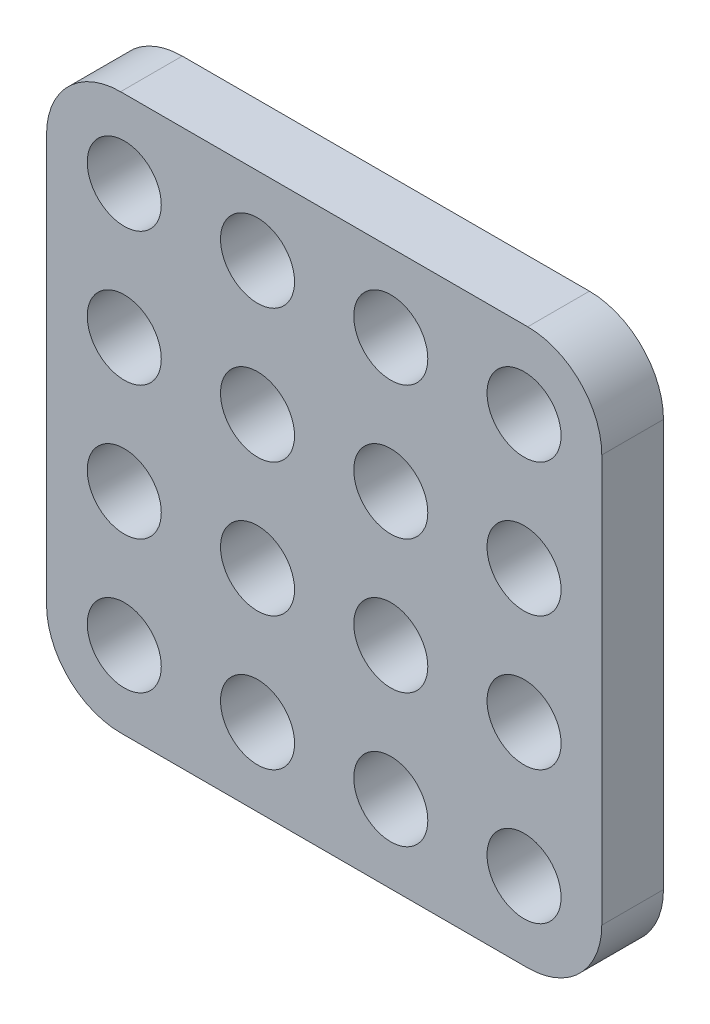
from build123d import *

# Parameters (mm, degrees)
MODEL_R            = 6
BOSS_EXTRU_1_DEPTH = 10


with BuildPart() as part:
    # Model → Boss.-Extru.1 (new body)
    with BuildSketch(Plane.XY):
        with BuildLine():
            Line((105.205005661, 230.510748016), (105.205005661, 164.510748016))
            ThreePointArc((105.205005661, 164.510748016), (101.690287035, 156.025466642), (93.205005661, 152.510748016))
            Line((93.205005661, 152.510748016), (27.205005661, 152.510748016))
            ThreePointArc((27.205005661, 152.510748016), (18.719724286, 156.025466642), (15.205005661, 164.510748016))
            Line((15.205005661, 164.510748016), (15.205005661, 230.510748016))
            ThreePointArc((15.205005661, 230.510748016), (18.719724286, 238.99602939), (27.205005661, 242.510748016))
            Line((27.205005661, 242.510748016), (93.205005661, 242.510748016))
            ThreePointArc((93.205005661, 242.510748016), (101.690287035, 238.99602939), (105.205005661, 230.510748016))
        make_face()
        with Locations((71.005005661, 208.310748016)):
            Circle(MODEL_R, mode=Mode.SUBTRACT)
        with Locations((92.605005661, 229.910748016)):
            Circle(MODEL_R, mode=Mode.SUBTRACT)
        with Locations((92.605005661, 208.310748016)):
            Circle(MODEL_R, mode=Mode.SUBTRACT)
        with Locations((71.005005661, 186.710748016)):
            Circle(MODEL_R, mode=Mode.SUBTRACT)
        with Locations((27.805005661, 165.110748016)):
            Circle(MODEL_R, mode=Mode.SUBTRACT)
        with Locations((92.605005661, 186.710748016)):
            Circle(MODEL_R, mode=Mode.SUBTRACT)
        with Locations((27.805005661, 229.910748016)):
            Circle(MODEL_R, mode=Mode.SUBTRACT)
        with Locations((27.805005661, 186.710748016)):
            Circle(MODEL_R, mode=Mode.SUBTRACT)
        with Locations((71.005005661, 165.110748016)):
            Circle(MODEL_R, mode=Mode.SUBTRACT)
        with Locations((92.605005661, 165.110748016)):
            Circle(MODEL_R, mode=Mode.SUBTRACT)
        with Locations((49.405005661, 165.110748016)):
            Circle(MODEL_R, mode=Mode.SUBTRACT)
        with Locations((27.805005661, 208.310748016)):
            Circle(MODEL_R, mode=Mode.SUBTRACT)
        with Locations((49.405005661, 208.310748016)):
            Circle(MODEL_R, mode=Mode.SUBTRACT)
        with Locations((49.405005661, 229.910748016)):
            Circle(MODEL_R, mode=Mode.SUBTRACT)
        with Locations((49.405005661, 186.710748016)):
            Circle(MODEL_R, mode=Mode.SUBTRACT)
        with Locations((71.005005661, 229.910748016)):
            Circle(MODEL_R, mode=Mode.SUBTRACT)
    extrude(amount=BOSS_EXTRU_1_DEPTH)


solid = part.part
